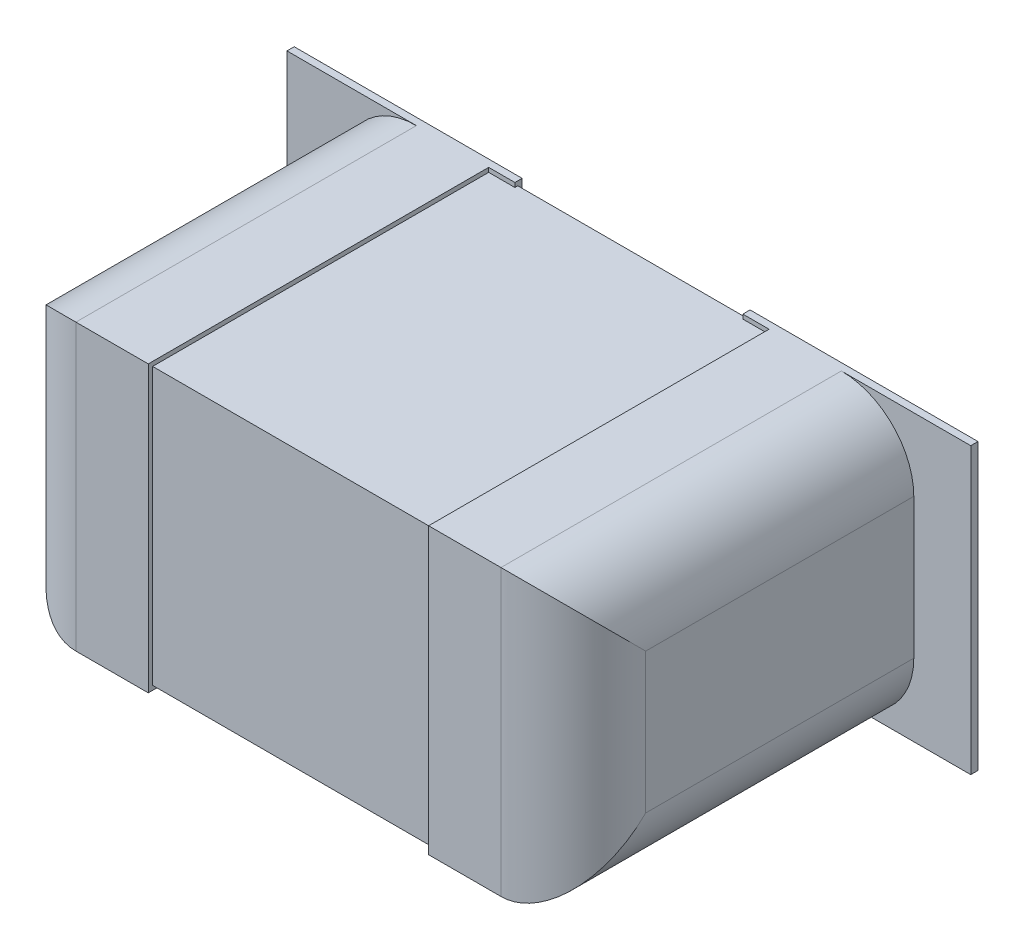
ISO-10303-21;
HEADER;
FILE_DESCRIPTION(('STEP AP214'),'2;1');
FILE_NAME('part.step','',(''),(''),'','','');
FILE_SCHEMA(('AUTOMOTIVE_DESIGN { 1 0 10303 214 1 1 1 1 }'));
ENDSEC;
DATA;
#1=APPLICATION_CONTEXT('core data for automotive mechanical design processes');
#2=APPLICATION_PROTOCOL_DEFINITION('international standard','automotive_design',2000,#1);
#3=PRODUCT_CONTEXT('',#1,'mechanical');
#4=PRODUCT('Part','Part','',(#3));
#5=PRODUCT_RELATED_PRODUCT_CATEGORY('part','',(#4));
#6=PRODUCT_DEFINITION_FORMATION('','',#4);
#7=PRODUCT_DEFINITION_CONTEXT('part definition',#1,'design');
#8=PRODUCT_DEFINITION('design','',#6,#7);
#9=PRODUCT_DEFINITION_SHAPE('','',#8);
#10=(LENGTH_UNIT() NAMED_UNIT(*) SI_UNIT(.MILLI.,.METRE.));
#11=(NAMED_UNIT(*) PLANE_ANGLE_UNIT() SI_UNIT($,.RADIAN.));
#12=(NAMED_UNIT(*) SI_UNIT($,.STERADIAN.) SOLID_ANGLE_UNIT());
#13=UNCERTAINTY_MEASURE_WITH_UNIT(LENGTH_MEASURE(1.E-05),#10,'distance_accuracy_value','');
#14=(GEOMETRIC_REPRESENTATION_CONTEXT(3) GLOBAL_UNCERTAINTY_ASSIGNED_CONTEXT((#13)) GLOBAL_UNIT_ASSIGNED_CONTEXT((#10,
#11,#12)) REPRESENTATION_CONTEXT('',''));
#15=CARTESIAN_POINT('',(0.,0.,0.));
#16=DIRECTION('',(0.,0.,1.));
#17=DIRECTION('',(1.,0.,0.));
#18=AXIS2_PLACEMENT_3D('',#15,#16,#17);
#19=CARTESIAN_POINT('',(0.500000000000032,-0.249999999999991,0.0762));
#20=DIRECTION('',(1.,0.,0.));
#21=DIRECTION('',(0.,0.,-1.));
#22=AXIS2_PLACEMENT_3D('',#19,#20,#21);
#23=PLANE('',#22);
#24=DIRECTION('',(0.,0.,-1.));
#25=VECTOR('',#24,1.);
#26=CARTESIAN_POINT('',(0.500000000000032,-0.122999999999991,0.68855504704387));
#27=LINE('',#26,#25);
#28=CARTESIAN_POINT('',(0.500000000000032,-0.122999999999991,0.0889));
#29=VERTEX_POINT('',#28);
#30=CARTESIAN_POINT('',(0.500000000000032,-0.122999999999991,0.559308));
#31=VERTEX_POINT('',#30);
#32=EDGE_CURVE('E324',#29,#31,#27,.F.);
#33=ORIENTED_EDGE('',*,*,#32,.F.);
#34=DIRECTION('',(0.,1.,0.));
#35=VECTOR('',#34,1.);
#36=CARTESIAN_POINT('',(0.500000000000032,0.,0.0889));
#37=LINE('',#36,#35);
#38=CARTESIAN_POINT('',(0.500000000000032,0.122999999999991,0.0889));
#39=VERTEX_POINT('',#38);
#40=EDGE_CURVE('E237',#39,#29,#37,.F.);
#41=ORIENTED_EDGE('',*,*,#40,.F.);
#42=DIRECTION('',(0.,0.,-1.));
#43=VECTOR('',#42,1.);
#44=CARTESIAN_POINT('',(0.500000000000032,0.122999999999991,0.68855504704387));
#45=LINE('',#44,#43);
#46=CARTESIAN_POINT('',(0.500000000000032,0.122999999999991,0.559308));
#47=VERTEX_POINT('',#46);
#48=EDGE_CURVE('E226',#47,#39,#45,.T.);
#49=ORIENTED_EDGE('',*,*,#48,.F.);
#50=DIRECTION('',(0.,1.,0.));
#51=VECTOR('',#50,1.);
#52=CARTESIAN_POINT('',(0.500000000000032,-0.252165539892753,0.559308));
#53=LINE('',#52,#51);
#54=EDGE_CURVE('E223',#31,#47,#53,.T.);
#55=ORIENTED_EDGE('',*,*,#54,.F.);
#56=EDGE_LOOP('',(#33,#41,#49,#55));
#57=FACE_BOUND('',#56,.T.);
#58=ADVANCED_FACE('F16',(#57),#23,.T.);
#59=CARTESIAN_POINT('',(-0.500000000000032,0.249999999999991,0.0762));
#60=DIRECTION('',(-1.,0.,0.));
#61=DIRECTION('',(0.,0.,1.));
#62=AXIS2_PLACEMENT_3D('',#59,#60,#61);
#63=PLANE('',#62);
#64=DIRECTION('',(0.,0.,-1.));
#65=VECTOR('',#64,1.);
#66=CARTESIAN_POINT('',(-0.500000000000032,0.122999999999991,0.68855504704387));
#67=LINE('',#66,#65);
#68=CARTESIAN_POINT('',(-0.500000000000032,0.122999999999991,0.0889));
#69=VERTEX_POINT('',#68);
#70=CARTESIAN_POINT('',(-0.500000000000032,0.122999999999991,0.559308));
#71=VERTEX_POINT('',#70);
#72=EDGE_CURVE('E308',#69,#71,#67,.F.);
#73=ORIENTED_EDGE('',*,*,#72,.F.);
#74=DIRECTION('',(0.,1.,0.));
#75=VECTOR('',#74,1.);
#76=CARTESIAN_POINT('',(-0.500000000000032,0.,0.0889));
#77=LINE('',#76,#75);
#78=CARTESIAN_POINT('',(-0.500000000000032,-0.122999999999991,0.0889));
#79=VERTEX_POINT('',#78);
#80=EDGE_CURVE('E312',#79,#69,#77,.T.);
#81=ORIENTED_EDGE('',*,*,#80,.F.);
#82=DIRECTION('',(0.,0.,-1.));
#83=VECTOR('',#82,1.);
#84=CARTESIAN_POINT('',(-0.500000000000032,-0.122999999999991,0.68855504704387));
#85=LINE('',#84,#83);
#86=CARTESIAN_POINT('',(-0.500000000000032,-0.122999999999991,0.559308));
#87=VERTEX_POINT('',#86);
#88=EDGE_CURVE('E315',#87,#79,#85,.T.);
#89=ORIENTED_EDGE('',*,*,#88,.F.);
#90=DIRECTION('',(0.,-1.,0.));
#91=VECTOR('',#90,1.);
#92=CARTESIAN_POINT('',(-0.500000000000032,0.25220810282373,0.559308));
#93=LINE('',#92,#91);
#94=EDGE_CURVE('E242',#71,#87,#93,.T.);
#95=ORIENTED_EDGE('',*,*,#94,.F.);
#96=EDGE_LOOP('',(#73,#81,#89,#95));
#97=FACE_BOUND('',#96,.T.);
#98=ADVANCED_FACE('F355',(#97),#63,.T.);
#99=CARTESIAN_POINT('',(-0.373000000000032,0.25220810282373,0.559308));
#100=DIRECTION('',(0.,-1.,0.));
#101=DIRECTION('',(0.,0.,-1.));
#102=AXIS2_PLACEMENT_3D('',#99,#100,#101);
#103=CYLINDRICAL_SURFACE('',#102,0.127);
#104=CARTESIAN_POINT('',(-0.373000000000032,-0.122999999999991,0.559308));
#105=DIRECTION('',(0.,-0.707106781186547,-0.707106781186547));
#106=DIRECTION('',(0.,0.707106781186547,-0.707106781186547));
#107=AXIS2_PLACEMENT_3D('',#104,#105,#106);
#108=ELLIPSE('',#107,0.179605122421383,0.127);
#109=CARTESIAN_POINT('',(-0.373000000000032,-0.249999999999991,0.686308));
#110=VERTEX_POINT('',#109);
#111=EDGE_CURVE('E316',#110,#87,#108,.T.);
#112=ORIENTED_EDGE('',*,*,#111,.F.);
#113=DIRECTION('',(0.,1.,0.));
#114=VECTOR('',#113,1.);
#115=CARTESIAN_POINT('',(-0.373000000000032,0.,0.686308));
#116=LINE('',#115,#114);
#117=CARTESIAN_POINT('',(-0.373000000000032,0.249999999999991,0.686308));
#118=VERTEX_POINT('',#117);
#119=EDGE_CURVE('E207',#118,#110,#116,.F.);
#120=ORIENTED_EDGE('',*,*,#119,.F.);
#121=CARTESIAN_POINT('',(-0.373000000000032,0.122999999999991,0.559308));
#122=DIRECTION('',(0.,0.707106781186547,-0.707106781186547));
#123=DIRECTION('',(0.,-0.707106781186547,-0.707106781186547));
#124=AXIS2_PLACEMENT_3D('',#121,#122,#123);
#125=ELLIPSE('',#124,0.179605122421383,0.127);
#126=EDGE_CURVE('E306',#71,#118,#125,.T.);
#127=ORIENTED_EDGE('',*,*,#126,.F.);
#128=ORIENTED_EDGE('',*,*,#94,.T.);
#129=EDGE_LOOP('',(#112,#120,#127,#128));
#130=FACE_BOUND('',#129,.T.);
#131=ADVANCED_FACE('F360',(#130),#103,.T.);
#132=CARTESIAN_POINT('',(0.373000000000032,-0.252165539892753,0.559308));
#133=DIRECTION('',(0.,1.,0.));
#134=DIRECTION('',(0.,0.,1.));
#135=AXIS2_PLACEMENT_3D('',#132,#133,#134);
#136=CYLINDRICAL_SURFACE('',#135,0.127);
#137=CARTESIAN_POINT('',(0.373000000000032,-0.122999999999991,0.559308));
#138=DIRECTION('',(0.,-0.707106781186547,-0.707106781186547));
#139=DIRECTION('',(0.,0.707106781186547,-0.707106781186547));
#140=AXIS2_PLACEMENT_3D('',#137,#138,#139);
#141=ELLIPSE('',#140,0.179605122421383,0.127);
#142=CARTESIAN_POINT('',(0.373000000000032,-0.249999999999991,0.686308));
#143=VERTEX_POINT('',#142);
#144=EDGE_CURVE('E322',#31,#143,#141,.T.);
#145=ORIENTED_EDGE('',*,*,#144,.F.);
#146=ORIENTED_EDGE('',*,*,#54,.T.);
#147=CARTESIAN_POINT('',(0.373000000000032,0.122999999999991,0.559308));
#148=DIRECTION('',(0.,0.707106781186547,-0.707106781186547));
#149=DIRECTION('',(0.,-0.707106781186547,-0.707106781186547));
#150=AXIS2_PLACEMENT_3D('',#147,#148,#149);
#151=ELLIPSE('',#150,0.179605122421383,0.127);
#152=CARTESIAN_POINT('',(0.373000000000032,0.249999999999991,0.686308));
#153=VERTEX_POINT('',#152);
#154=EDGE_CURVE('E19',#153,#47,#151,.T.);
#155=ORIENTED_EDGE('',*,*,#154,.F.);
#156=DIRECTION('',(0.,1.,0.));
#157=VECTOR('',#156,1.);
#158=CARTESIAN_POINT('',(0.373000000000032,0.,0.686308));
#159=LINE('',#158,#157);
#160=EDGE_CURVE('E197',#143,#153,#159,.T.);
#161=ORIENTED_EDGE('',*,*,#160,.F.);
#162=EDGE_LOOP('',(#145,#146,#155,#161));
#163=FACE_BOUND('',#162,.T.);
#164=ADVANCED_FACE('F221',(#163),#136,.T.);
#165=CARTESIAN_POINT('',(0.373000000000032,0.122999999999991,0.68855504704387));
#166=DIRECTION('',(0.,0.,-1.));
#167=DIRECTION('',(-1.,0.,0.));
#168=AXIS2_PLACEMENT_3D('',#165,#166,#167);
#169=CYLINDRICAL_SURFACE('',#168,0.127);
#170=ORIENTED_EDGE('',*,*,#48,.T.);
#171=CARTESIAN_POINT('',(0.373000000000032,0.122999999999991,0.0888999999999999));
#172=DIRECTION('',(0.,0.,-1.));
#173=DIRECTION('',(-1.,0.,0.));
#174=AXIS2_PLACEMENT_3D('',#171,#172,#173);
#175=CIRCLE('',#174,0.127);
#176=CARTESIAN_POINT('',(0.372860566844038,0.249999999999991,0.0889000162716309));
#177=VERTEX_POINT('',#176);
#178=EDGE_CURVE('E229',#177,#39,#175,.T.);
#179=ORIENTED_EDGE('',*,*,#178,.F.);
#180=DIRECTION('',(-0.000233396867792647,0.,-0.999999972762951));
#181=VECTOR('',#180,1.);
#182=CARTESIAN_POINT('',(0.373000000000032,0.249999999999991,0.686308));
#183=LINE('',#182,#181);
#184=EDGE_CURVE('E214',#153,#177,#183,.T.);
#185=ORIENTED_EDGE('',*,*,#184,.F.);
#186=ORIENTED_EDGE('',*,*,#154,.T.);
#187=EDGE_LOOP('',(#170,#179,#185,#186));
#188=FACE_BOUND('',#187,.T.);
#189=ADVANCED_FACE('F227',(#188),#169,.T.);
#190=CARTESIAN_POINT('',(0.5999988,-0.2500122,0.0762));
#191=DIRECTION('',(1.,0.,0.));
#192=DIRECTION('',(0.,0.,-1.));
#193=AXIS2_PLACEMENT_3D('',#190,#191,#192);
#194=PLANE('',#193);
#195=DIRECTION('',(0.,0.,-1.));
#196=VECTOR('',#195,1.);
#197=CARTESIAN_POINT('',(0.5999988,-0.249999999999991,0.0762));
#198=LINE('',#197,#196);
#199=CARTESIAN_POINT('',(0.5999988,-0.249999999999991,0.0762));
#200=VERTEX_POINT('',#199);
#201=CARTESIAN_POINT('',(0.5999988,-0.249999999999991,0.0889));
#202=VERTEX_POINT('',#201);
#203=EDGE_CURVE('E294',#200,#202,#198,.F.);
#204=ORIENTED_EDGE('',*,*,#203,.F.);
#205=DIRECTION('',(0.,1.,0.));
#206=VECTOR('',#205,1.);
#207=CARTESIAN_POINT('',(0.5999988,0.,0.0762));
#208=LINE('',#207,#206);
#209=CARTESIAN_POINT('',(0.5999988,0.249999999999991,0.0762));
#210=VERTEX_POINT('',#209);
#211=EDGE_CURVE('E297',#200,#210,#208,.T.);
#212=ORIENTED_EDGE('',*,*,#211,.T.);
#213=DIRECTION('',(0.,0.,1.));
#214=VECTOR('',#213,1.);
#215=CARTESIAN_POINT('',(0.5999988,0.249999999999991,0.0762));
#216=LINE('',#215,#214);
#217=CARTESIAN_POINT('',(0.5999988,0.249999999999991,0.0889));
#218=VERTEX_POINT('',#217);
#219=EDGE_CURVE('E233',#218,#210,#216,.F.);
#220=ORIENTED_EDGE('',*,*,#219,.F.);
#221=DIRECTION('',(0.,1.,0.));
#222=VECTOR('',#221,1.);
#223=CARTESIAN_POINT('',(0.5999988,0.,0.0889));
#224=LINE('',#223,#222);
#225=EDGE_CURVE('E240',#202,#218,#224,.T.);
#226=ORIENTED_EDGE('',*,*,#225,.F.);
#227=EDGE_LOOP('',(#204,#212,#220,#226));
#228=FACE_BOUND('',#227,.T.);
#229=ADVANCED_FACE('F335',(#228),#194,.T.);
#230=CARTESIAN_POINT('',(0.,0.,0.0889));
#231=DIRECTION('',(0.,0.,1.));
#232=DIRECTION('',(1.,0.,0.));
#233=AXIS2_PLACEMENT_3D('',#230,#231,#232);
#234=PLANE('',#233);
#235=ORIENTED_EDGE('',*,*,#178,.T.);
#236=ORIENTED_EDGE('',*,*,#40,.T.);
#237=CARTESIAN_POINT('',(0.373000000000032,-0.122999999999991,0.0888999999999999));
#238=DIRECTION('',(0.,0.,-1.));
#239=DIRECTION('',(-1.,0.,0.));
#240=AXIS2_PLACEMENT_3D('',#237,#238,#239);
#241=CIRCLE('',#240,0.127);
#242=CARTESIAN_POINT('',(0.372860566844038,-0.249999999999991,0.0889000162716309));
#243=VERTEX_POINT('',#242);
#244=EDGE_CURVE('E319',#243,#29,#241,.F.);
#245=ORIENTED_EDGE('',*,*,#244,.F.);
#246=DIRECTION('',(1.,0.,0.));
#247=VECTOR('',#246,1.);
#248=CARTESIAN_POINT('',(-0.500000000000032,-0.249999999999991,0.0889));
#249=LINE('',#248,#247);
#250=EDGE_CURVE('E296',#202,#243,#249,.F.);
#251=ORIENTED_EDGE('',*,*,#250,.F.);
#252=ORIENTED_EDGE('',*,*,#225,.T.);
#253=DIRECTION('',(1.,0.,0.));
#254=VECTOR('',#253,1.);
#255=CARTESIAN_POINT('',(0.500000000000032,0.249999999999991,0.0889));
#256=LINE('',#255,#254);
#257=EDGE_CURVE('E231',#177,#218,#256,.T.);
#258=ORIENTED_EDGE('',*,*,#257,.F.);
#259=EDGE_LOOP('',(#235,#236,#245,#251,#252,#258));
#260=FACE_BOUND('',#259,.T.);
#261=ADVANCED_FACE('F328',(#260),#234,.T.);
#262=CARTESIAN_POINT('',(0.373000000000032,-0.122999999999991,0.68855504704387));
#263=DIRECTION('',(0.,0.,-1.));
#264=DIRECTION('',(-1.,0.,0.));
#265=AXIS2_PLACEMENT_3D('',#262,#263,#264);
#266=CYLINDRICAL_SURFACE('',#265,0.127);
#267=DIRECTION('',(0.000233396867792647,0.,0.999999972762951));
#268=VECTOR('',#267,1.);
#269=CARTESIAN_POINT('',(0.37286056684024,-0.249999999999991,0.0889));
#270=LINE('',#269,#268);
#271=EDGE_CURVE('E342',#243,#143,#270,.T.);
#272=ORIENTED_EDGE('',*,*,#271,.F.);
#273=ORIENTED_EDGE('',*,*,#244,.T.);
#274=ORIENTED_EDGE('',*,*,#32,.T.);
#275=ORIENTED_EDGE('',*,*,#144,.T.);
#276=EDGE_LOOP('',(#272,#273,#274,#275));
#277=FACE_BOUND('',#276,.T.);
#278=ADVANCED_FACE('F352',(#277),#266,.T.);
#279=CARTESIAN_POINT('',(-0.373000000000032,-0.122999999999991,0.68855504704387));
#280=DIRECTION('',(0.,0.,-1.));
#281=DIRECTION('',(-1.,0.,0.));
#282=AXIS2_PLACEMENT_3D('',#279,#280,#281);
#283=CYLINDRICAL_SURFACE('',#282,0.127);
#284=ORIENTED_EDGE('',*,*,#88,.T.);
#285=CARTESIAN_POINT('',(-0.373000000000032,-0.122999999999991,0.0888999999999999));
#286=DIRECTION('',(0.,0.,-1.));
#287=DIRECTION('',(-1.,0.,0.));
#288=AXIS2_PLACEMENT_3D('',#285,#286,#287);
#289=CIRCLE('',#288,0.127);
#290=CARTESIAN_POINT('',(-0.372860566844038,-0.249999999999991,0.0889000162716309));
#291=VERTEX_POINT('',#290);
#292=EDGE_CURVE('E309',#291,#79,#289,.T.);
#293=ORIENTED_EDGE('',*,*,#292,.F.);
#294=DIRECTION('',(0.000233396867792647,0.,-0.999999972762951));
#295=VECTOR('',#294,1.);
#296=CARTESIAN_POINT('',(-0.373000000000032,-0.249999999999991,0.686308));
#297=LINE('',#296,#295);
#298=EDGE_CURVE('E289',#110,#291,#297,.T.);
#299=ORIENTED_EDGE('',*,*,#298,.F.);
#300=ORIENTED_EDGE('',*,*,#111,.T.);
#301=EDGE_LOOP('',(#284,#293,#299,#300));
#302=FACE_BOUND('',#301,.T.);
#303=ADVANCED_FACE('F449',(#302),#283,.T.);
#304=CARTESIAN_POINT('',(-0.5999988,0.2500122,0.0762));
#305=DIRECTION('',(-1.,0.,0.));
#306=DIRECTION('',(0.,0.,1.));
#307=AXIS2_PLACEMENT_3D('',#304,#305,#306);
#308=PLANE('',#307);
#309=DIRECTION('',(0.,0.,1.));
#310=VECTOR('',#309,1.);
#311=CARTESIAN_POINT('',(-0.5999988,0.249999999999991,0.0762));
#312=LINE('',#311,#310);
#313=CARTESIAN_POINT('',(-0.5999988,0.249999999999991,0.0762));
#314=VERTEX_POINT('',#313);
#315=CARTESIAN_POINT('',(-0.5999988,0.249999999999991,0.0889));
#316=VERTEX_POINT('',#315);
#317=EDGE_CURVE('E277',#314,#316,#312,.T.);
#318=ORIENTED_EDGE('',*,*,#317,.F.);
#319=DIRECTION('',(0.,1.,0.));
#320=VECTOR('',#319,1.);
#321=CARTESIAN_POINT('',(-0.5999988,0.,0.0762));
#322=LINE('',#321,#320);
#323=CARTESIAN_POINT('',(-0.5999988,-0.249999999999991,0.0762));
#324=VERTEX_POINT('',#323);
#325=EDGE_CURVE('E280',#314,#324,#322,.F.);
#326=ORIENTED_EDGE('',*,*,#325,.T.);
#327=DIRECTION('',(0.,0.,-1.));
#328=VECTOR('',#327,1.);
#329=CARTESIAN_POINT('',(-0.5999988,-0.249999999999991,0.0762));
#330=LINE('',#329,#328);
#331=CARTESIAN_POINT('',(-0.5999988,-0.249999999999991,0.0889));
#332=VERTEX_POINT('',#331);
#333=EDGE_CURVE('E284',#332,#324,#330,.T.);
#334=ORIENTED_EDGE('',*,*,#333,.F.);
#335=DIRECTION('',(0.,1.,0.));
#336=VECTOR('',#335,1.);
#337=CARTESIAN_POINT('',(-0.5999988,0.,0.0889));
#338=LINE('',#337,#336);
#339=EDGE_CURVE('E313',#316,#332,#338,.F.);
#340=ORIENTED_EDGE('',*,*,#339,.F.);
#341=EDGE_LOOP('',(#318,#326,#334,#340));
#342=FACE_BOUND('',#341,.T.);
#343=ADVANCED_FACE('F445',(#342),#308,.T.);
#344=CARTESIAN_POINT('',(0.,0.,0.0889));
#345=DIRECTION('',(0.,0.,1.));
#346=DIRECTION('',(1.,0.,0.));
#347=AXIS2_PLACEMENT_3D('',#344,#345,#346);
#348=PLANE('',#347);
#349=ORIENTED_EDGE('',*,*,#292,.T.);
#350=ORIENTED_EDGE('',*,*,#80,.T.);
#351=CARTESIAN_POINT('',(-0.373000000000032,0.122999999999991,0.0888999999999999));
#352=DIRECTION('',(0.,0.,-1.));
#353=DIRECTION('',(-1.,0.,0.));
#354=AXIS2_PLACEMENT_3D('',#351,#352,#353);
#355=CIRCLE('',#354,0.127);
#356=CARTESIAN_POINT('',(-0.372860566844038,0.249999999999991,0.0889000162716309));
#357=VERTEX_POINT('',#356);
#358=EDGE_CURVE('E303',#357,#69,#355,.F.);
#359=ORIENTED_EDGE('',*,*,#358,.F.);
#360=DIRECTION('',(1.,0.,0.));
#361=VECTOR('',#360,1.);
#362=CARTESIAN_POINT('',(0.500000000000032,0.249999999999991,0.0889));
#363=LINE('',#362,#361);
#364=EDGE_CURVE('E279',#316,#357,#363,.T.);
#365=ORIENTED_EDGE('',*,*,#364,.F.);
#366=ORIENTED_EDGE('',*,*,#339,.T.);
#367=DIRECTION('',(1.,0.,0.));
#368=VECTOR('',#367,1.);
#369=CARTESIAN_POINT('',(-0.500000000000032,-0.249999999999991,0.0889));
#370=LINE('',#369,#368);
#371=EDGE_CURVE('E286',#291,#332,#370,.F.);
#372=ORIENTED_EDGE('',*,*,#371,.F.);
#373=EDGE_LOOP('',(#349,#350,#359,#365,#366,#372));
#374=FACE_BOUND('',#373,.T.);
#375=ADVANCED_FACE('F441',(#374),#348,.T.);
#376=CARTESIAN_POINT('',(-0.373000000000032,0.122999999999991,0.68855504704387));
#377=DIRECTION('',(0.,0.,-1.));
#378=DIRECTION('',(-1.,0.,0.));
#379=AXIS2_PLACEMENT_3D('',#376,#377,#378);
#380=CYLINDRICAL_SURFACE('',#379,0.127);
#381=DIRECTION('',(-0.000233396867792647,0.,0.999999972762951));
#382=VECTOR('',#381,1.);
#383=CARTESIAN_POINT('',(-0.37286056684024,0.249999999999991,0.0889));
#384=LINE('',#383,#382);
#385=EDGE_CURVE('E482',#357,#118,#384,.T.);
#386=ORIENTED_EDGE('',*,*,#385,.F.);
#387=ORIENTED_EDGE('',*,*,#358,.T.);
#388=ORIENTED_EDGE('',*,*,#72,.T.);
#389=ORIENTED_EDGE('',*,*,#126,.T.);
#390=EDGE_LOOP('',(#386,#387,#388,#389));
#391=FACE_BOUND('',#390,.T.);
#392=ADVANCED_FACE('F437',(#391),#380,.T.);
#393=CARTESIAN_POINT('',(0.,0.,0.686308));
#394=DIRECTION('',(0.,0.,1.));
#395=DIRECTION('',(1.,0.,0.));
#396=AXIS2_PLACEMENT_3D('',#393,#394,#395);
#397=PLANE('',#396);
#398=DIRECTION('',(1.,0.,0.));
#399=VECTOR('',#398,1.);
#400=CARTESIAN_POINT('',(0.500000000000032,0.249999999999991,0.686308));
#401=LINE('',#400,#399);
#402=CARTESIAN_POINT('',(-0.246000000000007,0.249999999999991,0.686308));
#403=VERTEX_POINT('',#402);
#404=EDGE_CURVE('E276',#118,#403,#401,.T.);
#405=ORIENTED_EDGE('',*,*,#404,.F.);
#406=ORIENTED_EDGE('',*,*,#119,.T.);
#407=DIRECTION('',(1.,0.,0.));
#408=VECTOR('',#407,1.);
#409=CARTESIAN_POINT('',(-0.500000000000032,-0.249999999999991,0.686308));
#410=LINE('',#409,#408);
#411=CARTESIAN_POINT('',(-0.246000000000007,-0.250002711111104,0.686308));
#412=VERTEX_POINT('',#411);
#413=EDGE_CURVE('E293',#412,#110,#410,.F.);
#414=ORIENTED_EDGE('',*,*,#413,.F.);
#415=DIRECTION('',(0.,1.,0.));
#416=VECTOR('',#415,1.);
#417=CARTESIAN_POINT('',(-0.246000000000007,-0.249999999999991,0.686308));
#418=LINE('',#417,#416);
#419=EDGE_CURVE('E513',#412,#403,#418,.T.);
#420=ORIENTED_EDGE('',*,*,#419,.T.);
#421=EDGE_LOOP('',(#405,#406,#414,#420));
#422=FACE_BOUND('',#421,.T.);
#423=ADVANCED_FACE('F434',(#422),#397,.T.);
#424=CARTESIAN_POINT('',(0.,0.,0.686308));
#425=DIRECTION('',(0.,0.,1.));
#426=DIRECTION('',(1.,0.,0.));
#427=AXIS2_PLACEMENT_3D('',#424,#425,#426);
#428=PLANE('',#427);
#429=DIRECTION('',(1.,0.,0.));
#430=VECTOR('',#429,1.);
#431=CARTESIAN_POINT('',(-0.500000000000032,-0.249999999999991,0.686308));
#432=LINE('',#431,#430);
#433=CARTESIAN_POINT('',(0.246000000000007,-0.249999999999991,0.686308));
#434=VERTEX_POINT('',#433);
#435=EDGE_CURVE('E203',#143,#434,#432,.F.);
#436=ORIENTED_EDGE('',*,*,#435,.F.);
#437=ORIENTED_EDGE('',*,*,#160,.T.);
#438=DIRECTION('',(1.,0.,0.));
#439=VECTOR('',#438,1.);
#440=CARTESIAN_POINT('',(0.500000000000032,0.249999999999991,0.686308));
#441=LINE('',#440,#439);
#442=CARTESIAN_POINT('',(0.246000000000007,0.250002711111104,0.686308));
#443=VERTEX_POINT('',#442);
#444=EDGE_CURVE('E201',#443,#153,#441,.T.);
#445=ORIENTED_EDGE('',*,*,#444,.F.);
#446=DIRECTION('',(0.,1.,0.));
#447=VECTOR('',#446,1.);
#448=CARTESIAN_POINT('',(0.246000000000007,-0.249999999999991,0.686308));
#449=LINE('',#448,#447);
#450=EDGE_CURVE('E568',#443,#434,#449,.F.);
#451=ORIENTED_EDGE('',*,*,#450,.T.);
#452=EDGE_LOOP('',(#436,#437,#445,#451));
#453=FACE_BOUND('',#452,.T.);
#454=ADVANCED_FACE('F199',(#453),#428,.T.);
#455=CARTESIAN_POINT('',(0.,0.,0.0889));
#456=DIRECTION('',(0.,0.,1.));
#457=DIRECTION('',(1.,0.,0.));
#458=AXIS2_PLACEMENT_3D('',#455,#456,#457);
#459=PLANE('',#458);
#460=DIRECTION('',(1.,0.,0.));
#461=VECTOR('',#460,1.);
#462=CARTESIAN_POINT('',(-0.246000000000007,0.242379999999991,0.0889));
#463=LINE('',#462,#461);
#464=CARTESIAN_POINT('',(0.1999996,0.242379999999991,0.0889));
#465=VERTEX_POINT('',#464);
#466=CARTESIAN_POINT('',(0.246000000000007,0.242379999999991,0.0889));
#467=VERTEX_POINT('',#466);
#468=EDGE_CURVE('E529',#465,#467,#463,.T.);
#469=ORIENTED_EDGE('',*,*,#468,.T.);
#470=DIRECTION('',(0.,1.,0.));
#471=VECTOR('',#470,1.);
#472=CARTESIAN_POINT('',(0.246000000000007,-0.249999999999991,0.0889));
#473=LINE('',#472,#471);
#474=CARTESIAN_POINT('',(0.246000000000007,0.250002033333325,0.0889));
#475=VERTEX_POINT('',#474);
#476=EDGE_CURVE('E558',#467,#475,#473,.T.);
#477=ORIENTED_EDGE('',*,*,#476,.T.);
#478=DIRECTION('',(1.,0.,0.));
#479=VECTOR('',#478,1.);
#480=CARTESIAN_POINT('',(0.500000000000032,0.249999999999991,0.0889));
#481=LINE('',#480,#479);
#482=CARTESIAN_POINT('',(0.1999996,0.249999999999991,0.0889));
#483=VERTEX_POINT('',#482);
#484=EDGE_CURVE('E301',#483,#475,#481,.T.);
#485=ORIENTED_EDGE('',*,*,#484,.F.);
#486=DIRECTION('',(0.,1.,0.));
#487=VECTOR('',#486,1.);
#488=CARTESIAN_POINT('',(0.1999996,0.2500122,0.0889));
#489=LINE('',#488,#487);
#490=EDGE_CURVE('E257',#465,#483,#489,.T.);
#491=ORIENTED_EDGE('',*,*,#490,.F.);
#492=EDGE_LOOP('',(#469,#477,#485,#491));
#493=FACE_BOUND('',#492,.T.);
#494=ADVANCED_FACE('F428',(#493),#459,.T.);
#495=CARTESIAN_POINT('',(0.500000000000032,0.249999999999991,0.0762));
#496=DIRECTION('',(0.,1.,0.));
#497=DIRECTION('',(0.,0.,1.));
#498=AXIS2_PLACEMENT_3D('',#495,#496,#497);
#499=PLANE('',#498);
#500=ORIENTED_EDGE('',*,*,#484,.T.);
#501=DIRECTION('',(0.,0.,-1.));
#502=VECTOR('',#501,1.);
#503=CARTESIAN_POINT('',(0.246000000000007,0.25000406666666,0.08382));
#504=LINE('',#503,#502);
#505=EDGE_CURVE('E217',#475,#443,#504,.F.);
#506=ORIENTED_EDGE('',*,*,#505,.T.);
#507=ORIENTED_EDGE('',*,*,#444,.T.);
#508=ORIENTED_EDGE('',*,*,#184,.T.);
#509=ORIENTED_EDGE('',*,*,#257,.T.);
#510=ORIENTED_EDGE('',*,*,#219,.T.);
#511=DIRECTION('',(1.,0.,0.));
#512=VECTOR('',#511,1.);
#513=CARTESIAN_POINT('',(0.500000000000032,0.249999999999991,0.0762));
#514=LINE('',#513,#512);
#515=CARTESIAN_POINT('',(0.1999996,0.249999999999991,0.0762));
#516=VERTEX_POINT('',#515);
#517=EDGE_CURVE('E298',#210,#516,#514,.F.);
#518=ORIENTED_EDGE('',*,*,#517,.T.);
#519=DIRECTION('',(0.,0.,-1.));
#520=VECTOR('',#519,1.);
#521=CARTESIAN_POINT('',(0.1999996,0.249999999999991,0.0762));
#522=LINE('',#521,#520);
#523=EDGE_CURVE('E255',#483,#516,#522,.T.);
#524=ORIENTED_EDGE('',*,*,#523,.F.);
#525=EDGE_LOOP('',(#500,#506,#507,#508,#509,#510,#518,#524));
#526=FACE_BOUND('',#525,.T.);
#527=ADVANCED_FACE('F211',(#526),#499,.T.);
#528=CARTESIAN_POINT('',(0.,0.,0.0762));
#529=DIRECTION('',(0.,0.,1.));
#530=DIRECTION('',(1.,0.,0.));
#531=AXIS2_PLACEMENT_3D('',#528,#529,#530);
#532=PLANE('',#531);
#533=DIRECTION('',(1.,0.,0.));
#534=VECTOR('',#533,1.);
#535=CARTESIAN_POINT('',(-0.500000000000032,-0.249999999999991,0.0762));
#536=LINE('',#535,#534);
#537=CARTESIAN_POINT('',(0.1999996,-0.249999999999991,0.0762));
#538=VERTEX_POINT('',#537);
#539=EDGE_CURVE('E290',#538,#200,#536,.T.);
#540=ORIENTED_EDGE('',*,*,#539,.F.);
#541=DIRECTION('',(0.,1.,0.));
#542=VECTOR('',#541,1.);
#543=CARTESIAN_POINT('',(0.1999996,0.2500122,0.0762));
#544=LINE('',#543,#542);
#545=EDGE_CURVE('E254',#516,#538,#544,.F.);
#546=ORIENTED_EDGE('',*,*,#545,.F.);
#547=ORIENTED_EDGE('',*,*,#517,.F.);
#548=ORIENTED_EDGE('',*,*,#211,.F.);
#549=EDGE_LOOP('',(#540,#546,#547,#548));
#550=FACE_BOUND('',#549,.T.);
#551=ADVANCED_FACE('F423',(#550),#532,.F.);
#552=CARTESIAN_POINT('',(-0.500000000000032,-0.249999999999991,0.0762));
#553=DIRECTION('',(0.,-1.,0.));
#554=DIRECTION('',(0.,0.,-1.));
#555=AXIS2_PLACEMENT_3D('',#552,#553,#554);
#556=PLANE('',#555);
#557=DIRECTION('',(0.,0.,1.));
#558=VECTOR('',#557,1.);
#559=CARTESIAN_POINT('',(0.1999996,-0.249999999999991,0.0762));
#560=LINE('',#559,#558);
#561=CARTESIAN_POINT('',(0.1999996,-0.249999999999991,0.0889));
#562=VERTEX_POINT('',#561);
#563=EDGE_CURVE('E251',#538,#562,#560,.T.);
#564=ORIENTED_EDGE('',*,*,#563,.F.);
#565=ORIENTED_EDGE('',*,*,#539,.T.);
#566=ORIENTED_EDGE('',*,*,#203,.T.);
#567=ORIENTED_EDGE('',*,*,#250,.T.);
#568=ORIENTED_EDGE('',*,*,#271,.T.);
#569=ORIENTED_EDGE('',*,*,#435,.T.);
#570=DIRECTION('',(0.,0.,-1.));
#571=VECTOR('',#570,1.);
#572=CARTESIAN_POINT('',(0.246000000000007,-0.249999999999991,0.08382));
#573=LINE('',#572,#571);
#574=CARTESIAN_POINT('',(0.246000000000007,-0.249999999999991,0.0889));
#575=VERTEX_POINT('',#574);
#576=EDGE_CURVE('E264',#434,#575,#573,.T.);
#577=ORIENTED_EDGE('',*,*,#576,.T.);
#578=DIRECTION('',(1.,0.,0.));
#579=VECTOR('',#578,1.);
#580=CARTESIAN_POINT('',(0.,-0.249999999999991,0.0889));
#581=LINE('',#580,#579);
#582=EDGE_CURVE('E258',#562,#575,#581,.T.);
#583=ORIENTED_EDGE('',*,*,#582,.F.);
#584=EDGE_LOOP('',(#564,#565,#566,#567,#568,#569,#577,#583));
#585=FACE_BOUND('',#584,.T.);
#586=ADVANCED_FACE('F347',(#585),#556,.T.);
#587=CARTESIAN_POINT('',(-0.500000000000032,-0.249999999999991,0.0762));
#588=DIRECTION('',(0.,-1.,0.));
#589=DIRECTION('',(0.,0.,-1.));
#590=AXIS2_PLACEMENT_3D('',#587,#588,#589);
#591=PLANE('',#590);
#592=DIRECTION('',(1.,0.,0.));
#593=VECTOR('',#592,1.);
#594=CARTESIAN_POINT('',(0.,-0.25000406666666,0.0889));
#595=LINE('',#594,#593);
#596=CARTESIAN_POINT('',(-0.246000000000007,-0.250003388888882,0.0889));
#597=VERTEX_POINT('',#596);
#598=CARTESIAN_POINT('',(-0.1999996,-0.250002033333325,0.0889));
#599=VERTEX_POINT('',#598);
#600=EDGE_CURVE('E506',#597,#599,#595,.T.);
#601=ORIENTED_EDGE('',*,*,#600,.F.);
#602=DIRECTION('',(0.,0.,1.));
#603=VECTOR('',#602,1.);
#604=CARTESIAN_POINT('',(-0.246000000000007,-0.25000406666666,0.0762));
#605=LINE('',#604,#603);
#606=EDGE_CURVE('E505',#597,#412,#605,.T.);
#607=ORIENTED_EDGE('',*,*,#606,.T.);
#608=ORIENTED_EDGE('',*,*,#413,.T.);
#609=ORIENTED_EDGE('',*,*,#298,.T.);
#610=ORIENTED_EDGE('',*,*,#371,.T.);
#611=ORIENTED_EDGE('',*,*,#333,.T.);
#612=DIRECTION('',(1.,0.,0.));
#613=VECTOR('',#612,1.);
#614=CARTESIAN_POINT('',(-0.500000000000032,-0.249999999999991,0.0762));
#615=LINE('',#614,#613);
#616=CARTESIAN_POINT('',(-0.1999996,-0.249999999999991,0.0762));
#617=VERTEX_POINT('',#616);
#618=EDGE_CURVE('E281',#324,#617,#615,.T.);
#619=ORIENTED_EDGE('',*,*,#618,.T.);
#620=DIRECTION('',(0.,0.,-1.));
#621=VECTOR('',#620,1.);
#622=CARTESIAN_POINT('',(-0.1999996,-0.249999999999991,0.0762));
#623=LINE('',#622,#621);
#624=EDGE_CURVE('E248',#599,#617,#623,.T.);
#625=ORIENTED_EDGE('',*,*,#624,.F.);
#626=EDGE_LOOP('',(#601,#607,#608,#609,#610,#611,#619,#625));
#627=FACE_BOUND('',#626,.T.);
#628=ADVANCED_FACE('F416',(#627),#591,.T.);
#629=CARTESIAN_POINT('',(0.,0.,0.0762));
#630=DIRECTION('',(0.,0.,1.));
#631=DIRECTION('',(1.,0.,0.));
#632=AXIS2_PLACEMENT_3D('',#629,#630,#631);
#633=PLANE('',#632);
#634=DIRECTION('',(1.,0.,0.));
#635=VECTOR('',#634,1.);
#636=CARTESIAN_POINT('',(0.500000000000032,0.249999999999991,0.0762));
#637=LINE('',#636,#635);
#638=CARTESIAN_POINT('',(-0.1999996,0.249999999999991,0.0762));
#639=VERTEX_POINT('',#638);
#640=EDGE_CURVE('E273',#639,#314,#637,.F.);
#641=ORIENTED_EDGE('',*,*,#640,.F.);
#642=DIRECTION('',(0.,1.,0.));
#643=VECTOR('',#642,1.);
#644=CARTESIAN_POINT('',(-0.1999996,-0.2500122,0.0762));
#645=LINE('',#644,#643);
#646=EDGE_CURVE('E247',#617,#639,#645,.T.);
#647=ORIENTED_EDGE('',*,*,#646,.F.);
#648=ORIENTED_EDGE('',*,*,#618,.F.);
#649=ORIENTED_EDGE('',*,*,#325,.F.);
#650=EDGE_LOOP('',(#641,#647,#648,#649));
#651=FACE_BOUND('',#650,.T.);
#652=ADVANCED_FACE('F412',(#651),#633,.F.);
#653=CARTESIAN_POINT('',(0.500000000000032,0.249999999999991,0.0762));
#654=DIRECTION('',(0.,1.,0.));
#655=DIRECTION('',(0.,0.,1.));
#656=AXIS2_PLACEMENT_3D('',#653,#654,#655);
#657=PLANE('',#656);
#658=DIRECTION('',(0.,0.,1.));
#659=VECTOR('',#658,1.);
#660=CARTESIAN_POINT('',(-0.1999996,0.249999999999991,0.0762));
#661=LINE('',#660,#659);
#662=CARTESIAN_POINT('',(-0.1999996,0.249999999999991,0.0889));
#663=VERTEX_POINT('',#662);
#664=EDGE_CURVE('E244',#639,#663,#661,.T.);
#665=ORIENTED_EDGE('',*,*,#664,.F.);
#666=ORIENTED_EDGE('',*,*,#640,.T.);
#667=ORIENTED_EDGE('',*,*,#317,.T.);
#668=ORIENTED_EDGE('',*,*,#364,.T.);
#669=ORIENTED_EDGE('',*,*,#385,.T.);
#670=ORIENTED_EDGE('',*,*,#404,.T.);
#671=DIRECTION('',(0.,0.,1.));
#672=VECTOR('',#671,1.);
#673=CARTESIAN_POINT('',(-0.246000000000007,0.249999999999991,0.0762));
#674=LINE('',#673,#672);
#675=CARTESIAN_POINT('',(-0.246000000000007,0.249999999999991,0.0889));
#676=VERTEX_POINT('',#675);
#677=EDGE_CURVE('E269',#403,#676,#674,.F.);
#678=ORIENTED_EDGE('',*,*,#677,.T.);
#679=DIRECTION('',(-1.,0.,0.));
#680=VECTOR('',#679,1.);
#681=CARTESIAN_POINT('',(0.,0.249999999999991,0.0889));
#682=LINE('',#681,#680);
#683=EDGE_CURVE('E270',#663,#676,#682,.T.);
#684=ORIENTED_EDGE('',*,*,#683,.F.);
#685=EDGE_LOOP('',(#665,#666,#667,#668,#669,#670,#678,#684));
#686=FACE_BOUND('',#685,.T.);
#687=ADVANCED_FACE('F408',(#686),#657,.T.);
#688=CARTESIAN_POINT('',(0.,0.,0.0889));
#689=DIRECTION('',(0.,0.,1.));
#690=DIRECTION('',(1.,0.,0.));
#691=AXIS2_PLACEMENT_3D('',#688,#689,#690);
#692=PLANE('',#691);
#693=DIRECTION('',(0.,1.,0.));
#694=VECTOR('',#693,1.);
#695=CARTESIAN_POINT('',(-0.1999996,-0.2500122,0.0889));
#696=LINE('',#695,#694);
#697=CARTESIAN_POINT('',(-0.1999996,0.242379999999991,0.0889));
#698=VERTEX_POINT('',#697);
#699=EDGE_CURVE('E246',#663,#698,#696,.F.);
#700=ORIENTED_EDGE('',*,*,#699,.F.);
#701=ORIENTED_EDGE('',*,*,#683,.T.);
#702=DIRECTION('',(0.,1.,0.));
#703=VECTOR('',#702,1.);
#704=CARTESIAN_POINT('',(-0.246000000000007,0.,0.0889));
#705=LINE('',#704,#703);
#706=CARTESIAN_POINT('',(-0.246000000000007,0.242379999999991,0.0889));
#707=VERTEX_POINT('',#706);
#708=EDGE_CURVE('E265',#676,#707,#705,.F.);
#709=ORIENTED_EDGE('',*,*,#708,.T.);
#710=DIRECTION('',(1.,0.,0.));
#711=VECTOR('',#710,1.);
#712=CARTESIAN_POINT('',(-0.246000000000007,0.242379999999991,0.0889));
#713=LINE('',#712,#711);
#714=EDGE_CURVE('E272',#707,#698,#713,.T.);
#715=ORIENTED_EDGE('',*,*,#714,.T.);
#716=EDGE_LOOP('',(#700,#701,#709,#715));
#717=FACE_BOUND('',#716,.T.);
#718=ADVANCED_FACE('F404',(#717),#692,.T.);
#719=CARTESIAN_POINT('',(-0.246000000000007,0.242379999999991,0.0762));
#720=DIRECTION('',(0.,-1.,0.));
#721=DIRECTION('',(0.,0.,-1.));
#722=AXIS2_PLACEMENT_3D('',#719,#720,#721);
#723=PLANE('',#722);
#724=DIRECTION('',(-1.,0.,0.));
#725=VECTOR('',#724,1.);
#726=CARTESIAN_POINT('',(-0.246000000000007,0.242379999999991,0.678688));
#727=LINE('',#726,#725);
#728=CARTESIAN_POINT('',(-0.246000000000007,0.242379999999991,0.678688));
#729=VERTEX_POINT('',#728);
#730=CARTESIAN_POINT('',(0.246000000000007,0.242379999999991,0.678688));
#731=VERTEX_POINT('',#730);
#732=EDGE_CURVE('E536',#729,#731,#727,.F.);
#733=ORIENTED_EDGE('',*,*,#732,.T.);
#734=DIRECTION('',(0.,0.,-1.));
#735=VECTOR('',#734,1.);
#736=CARTESIAN_POINT('',(0.246000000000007,0.242379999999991,0.08382));
#737=LINE('',#736,#735);
#738=EDGE_CURVE('E553',#731,#467,#737,.T.);
#739=ORIENTED_EDGE('',*,*,#738,.T.);
#740=ORIENTED_EDGE('',*,*,#468,.F.);
#741=DIRECTION('',(0.,0.,1.));
#742=VECTOR('',#741,1.);
#743=CARTESIAN_POINT('',(0.1999996,0.242379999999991,0.0762));
#744=LINE('',#743,#742);
#745=CARTESIAN_POINT('',(0.1999996,0.242379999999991,0.08382));
#746=VERTEX_POINT('',#745);
#747=EDGE_CURVE('E261',#746,#465,#744,.T.);
#748=ORIENTED_EDGE('',*,*,#747,.F.);
#749=DIRECTION('',(1.,0.,0.));
#750=VECTOR('',#749,1.);
#751=CARTESIAN_POINT('',(-0.246000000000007,0.242379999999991,0.08382));
#752=LINE('',#751,#750);
#753=CARTESIAN_POINT('',(-0.1999996,0.242379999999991,0.08382));
#754=VERTEX_POINT('',#753);
#755=EDGE_CURVE('E591',#746,#754,#752,.F.);
#756=ORIENTED_EDGE('',*,*,#755,.T.);
#757=DIRECTION('',(0.,0.,-1.));
#758=VECTOR('',#757,1.);
#759=CARTESIAN_POINT('',(-0.1999996,0.242379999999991,0.0762));
#760=LINE('',#759,#758);
#761=EDGE_CURVE('E491',#698,#754,#760,.T.);
#762=ORIENTED_EDGE('',*,*,#761,.F.);
#763=ORIENTED_EDGE('',*,*,#714,.F.);
#764=DIRECTION('',(0.,0.,1.));
#765=VECTOR('',#764,1.);
#766=CARTESIAN_POINT('',(-0.246000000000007,0.242379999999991,0.0762));
#767=LINE('',#766,#765);
#768=EDGE_CURVE('E268',#707,#729,#767,.T.);
#769=ORIENTED_EDGE('',*,*,#768,.T.);
#770=EDGE_LOOP('',(#733,#739,#740,#748,#756,#762,#763,#769));
#771=FACE_BOUND('',#770,.T.);
#772=ADVANCED_FACE('F400',(#771),#723,.F.);
#773=CARTESIAN_POINT('',(0.,0.,0.0889));
#774=DIRECTION('',(0.,0.,1.));
#775=DIRECTION('',(1.,0.,0.));
#776=AXIS2_PLACEMENT_3D('',#773,#774,#775);
#777=PLANE('',#776);
#778=DIRECTION('',(1.,0.,0.));
#779=VECTOR('',#778,1.);
#780=CARTESIAN_POINT('',(-0.246000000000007,-0.242379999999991,0.0888999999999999));
#781=LINE('',#780,#779);
#782=CARTESIAN_POINT('',(-0.1999996,-0.242379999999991,0.0889));
#783=VERTEX_POINT('',#782);
#784=CARTESIAN_POINT('',(-0.246000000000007,-0.242379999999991,0.0889));
#785=VERTEX_POINT('',#784);
#786=EDGE_CURVE('E499',#783,#785,#781,.F.);
#787=ORIENTED_EDGE('',*,*,#786,.T.);
#788=DIRECTION('',(0.,1.,0.));
#789=VECTOR('',#788,1.);
#790=CARTESIAN_POINT('',(-0.246000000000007,-0.249999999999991,0.0889));
#791=LINE('',#790,#789);
#792=EDGE_CURVE('E502',#785,#597,#791,.F.);
#793=ORIENTED_EDGE('',*,*,#792,.T.);
#794=ORIENTED_EDGE('',*,*,#600,.T.);
#795=DIRECTION('',(0.,1.,0.));
#796=VECTOR('',#795,1.);
#797=CARTESIAN_POINT('',(-0.1999996,-0.2500122,0.0889));
#798=LINE('',#797,#796);
#799=EDGE_CURVE('E250',#783,#599,#798,.F.);
#800=ORIENTED_EDGE('',*,*,#799,.F.);
#801=EDGE_LOOP('',(#787,#793,#794,#800));
#802=FACE_BOUND('',#801,.T.);
#803=ADVANCED_FACE('F396',(#802),#777,.T.);
#804=CARTESIAN_POINT('',(-0.246000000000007,-0.249999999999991,0.0762));
#805=DIRECTION('',(-1.,0.,0.));
#806=DIRECTION('',(0.,0.,1.));
#807=AXIS2_PLACEMENT_3D('',#804,#805,#806);
#808=PLANE('',#807);
#809=DIRECTION('',(0.,1.,0.));
#810=VECTOR('',#809,1.);
#811=CARTESIAN_POINT('',(-0.246000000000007,0.249999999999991,0.678688));
#812=LINE('',#811,#810);
#813=CARTESIAN_POINT('',(-0.246000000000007,-0.242379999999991,0.678688));
#814=VERTEX_POINT('',#813);
#815=EDGE_CURVE('E532',#814,#729,#812,.T.);
#816=ORIENTED_EDGE('',*,*,#815,.T.);
#817=ORIENTED_EDGE('',*,*,#768,.F.);
#818=ORIENTED_EDGE('',*,*,#708,.F.);
#819=ORIENTED_EDGE('',*,*,#677,.F.);
#820=ORIENTED_EDGE('',*,*,#419,.F.);
#821=ORIENTED_EDGE('',*,*,#606,.F.);
#822=ORIENTED_EDGE('',*,*,#792,.F.);
#823=DIRECTION('',(0.,0.,1.));
#824=VECTOR('',#823,1.);
#825=CARTESIAN_POINT('',(-0.246000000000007,-0.242379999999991,0.686308));
#826=LINE('',#825,#824);
#827=EDGE_CURVE('E495',#785,#814,#826,.T.);
#828=ORIENTED_EDGE('',*,*,#827,.T.);
#829=EDGE_LOOP('',(#816,#817,#818,#819,#820,#821,#822,#828));
#830=FACE_BOUND('',#829,.T.);
#831=ADVANCED_FACE('F392',(#830),#808,.F.);
#832=CARTESIAN_POINT('',(-0.246000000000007,0.249999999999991,0.678688));
#833=DIRECTION('',(0.,0.,-1.));
#834=DIRECTION('',(-1.,0.,0.));
#835=AXIS2_PLACEMENT_3D('',#832,#833,#834);
#836=PLANE('',#835);
#837=DIRECTION('',(1.,0.,0.));
#838=VECTOR('',#837,1.);
#839=CARTESIAN_POINT('',(-0.246000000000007,-0.242379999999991,0.678688));
#840=LINE('',#839,#838);
#841=CARTESIAN_POINT('',(0.246000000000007,-0.242379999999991,0.678688));
#842=VERTEX_POINT('',#841);
#843=EDGE_CURVE('E498',#814,#842,#840,.T.);
#844=ORIENTED_EDGE('',*,*,#843,.T.);
#845=DIRECTION('',(0.,1.,0.));
#846=VECTOR('',#845,1.);
#847=CARTESIAN_POINT('',(0.246000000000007,-0.249999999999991,0.678688));
#848=LINE('',#847,#846);
#849=EDGE_CURVE('E535',#842,#731,#848,.T.);
#850=ORIENTED_EDGE('',*,*,#849,.T.);
#851=ORIENTED_EDGE('',*,*,#732,.F.);
#852=ORIENTED_EDGE('',*,*,#815,.F.);
#853=EDGE_LOOP('',(#844,#850,#851,#852));
#854=FACE_BOUND('',#853,.T.);
#855=ADVANCED_FACE('F388',(#854),#836,.F.);
#856=CARTESIAN_POINT('',(0.246000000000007,-0.249999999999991,0.08382));
#857=DIRECTION('',(1.,0.,0.));
#858=DIRECTION('',(0.,0.,-1.));
#859=AXIS2_PLACEMENT_3D('',#856,#857,#858);
#860=PLANE('',#859);
#861=ORIENTED_EDGE('',*,*,#450,.F.);
#862=ORIENTED_EDGE('',*,*,#505,.F.);
#863=ORIENTED_EDGE('',*,*,#476,.F.);
#864=ORIENTED_EDGE('',*,*,#738,.F.);
#865=ORIENTED_EDGE('',*,*,#849,.F.);
#866=DIRECTION('',(0.,0.,1.));
#867=VECTOR('',#866,1.);
#868=CARTESIAN_POINT('',(0.246000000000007,-0.242379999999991,0.686308));
#869=LINE('',#868,#867);
#870=CARTESIAN_POINT('',(0.246000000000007,-0.242379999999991,0.0889));
#871=VERTEX_POINT('',#870);
#872=EDGE_CURVE('E545',#842,#871,#869,.F.);
#873=ORIENTED_EDGE('',*,*,#872,.T.);
#874=DIRECTION('',(0.,1.,0.));
#875=VECTOR('',#874,1.);
#876=CARTESIAN_POINT('',(0.246000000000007,0.,0.0889));
#877=LINE('',#876,#875);
#878=EDGE_CURVE('E262',#575,#871,#877,.T.);
#879=ORIENTED_EDGE('',*,*,#878,.F.);
#880=ORIENTED_EDGE('',*,*,#576,.F.);
#881=EDGE_LOOP('',(#861,#862,#863,#864,#865,#873,#879,#880));
#882=FACE_BOUND('',#881,.T.);
#883=ADVANCED_FACE('F384',(#882),#860,.F.);
#884=CARTESIAN_POINT('',(0.,0.,0.0889));
#885=DIRECTION('',(0.,0.,1.));
#886=DIRECTION('',(1.,0.,0.));
#887=AXIS2_PLACEMENT_3D('',#884,#885,#886);
#888=PLANE('',#887);
#889=DIRECTION('',(0.,1.,0.));
#890=VECTOR('',#889,1.);
#891=CARTESIAN_POINT('',(0.1999996,0.2500122,0.0889));
#892=LINE('',#891,#890);
#893=CARTESIAN_POINT('',(0.1999996,-0.242379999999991,0.0889));
#894=VERTEX_POINT('',#893);
#895=EDGE_CURVE('E253',#562,#894,#892,.T.);
#896=ORIENTED_EDGE('',*,*,#895,.F.);
#897=ORIENTED_EDGE('',*,*,#582,.T.);
#898=ORIENTED_EDGE('',*,*,#878,.T.);
#899=DIRECTION('',(1.,0.,0.));
#900=VECTOR('',#899,1.);
#901=CARTESIAN_POINT('',(-0.246000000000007,-0.242379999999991,0.0888999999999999));
#902=LINE('',#901,#900);
#903=EDGE_CURVE('E582',#871,#894,#902,.F.);
#904=ORIENTED_EDGE('',*,*,#903,.T.);
#905=EDGE_LOOP('',(#896,#897,#898,#904));
#906=FACE_BOUND('',#905,.T.);
#907=ADVANCED_FACE('F380',(#906),#888,.T.);
#908=CARTESIAN_POINT('',(0.1999996,0.2500122,0.0762));
#909=DIRECTION('',(-1.,0.,0.));
#910=DIRECTION('',(0.,0.,1.));
#911=AXIS2_PLACEMENT_3D('',#908,#909,#910);
#912=PLANE('',#911);
#913=DIRECTION('',(0.,0.,1.));
#914=VECTOR('',#913,1.);
#915=CARTESIAN_POINT('',(0.1999996,-0.242379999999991,0.686308));
#916=LINE('',#915,#914);
#917=CARTESIAN_POINT('',(0.1999996,-0.242379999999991,0.08382));
#918=VERTEX_POINT('',#917);
#919=EDGE_CURVE('E585',#894,#918,#916,.F.);
#920=ORIENTED_EDGE('',*,*,#919,.T.);
#921=DIRECTION('',(0.,1.,0.));
#922=VECTOR('',#921,1.);
#923=CARTESIAN_POINT('',(0.1999996,-0.249999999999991,0.08382));
#924=LINE('',#923,#922);
#925=EDGE_CURVE('E588',#918,#746,#924,.T.);
#926=ORIENTED_EDGE('',*,*,#925,.T.);
#927=ORIENTED_EDGE('',*,*,#747,.T.);
#928=ORIENTED_EDGE('',*,*,#490,.T.);
#929=ORIENTED_EDGE('',*,*,#523,.T.);
#930=ORIENTED_EDGE('',*,*,#545,.T.);
#931=ORIENTED_EDGE('',*,*,#563,.T.);
#932=ORIENTED_EDGE('',*,*,#895,.T.);
#933=EDGE_LOOP('',(#920,#926,#927,#928,#929,#930,#931,#932));
#934=FACE_BOUND('',#933,.T.);
#935=ADVANCED_FACE('F376',(#934),#912,.T.);
#936=CARTESIAN_POINT('',(-0.246000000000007,-0.249999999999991,0.08382));
#937=DIRECTION('',(0.,0.,1.));
#938=DIRECTION('',(1.,0.,0.));
#939=AXIS2_PLACEMENT_3D('',#936,#937,#938);
#940=PLANE('',#939);
#941=DIRECTION('',(0.,1.,0.));
#942=VECTOR('',#941,1.);
#943=CARTESIAN_POINT('',(-0.1999996,-0.2500122,0.08382));
#944=LINE('',#943,#942);
#945=CARTESIAN_POINT('',(-0.1999996,-0.242379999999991,0.08382));
#946=VERTEX_POINT('',#945);
#947=EDGE_CURVE('E33',#754,#946,#944,.F.);
#948=ORIENTED_EDGE('',*,*,#947,.F.);
#949=ORIENTED_EDGE('',*,*,#755,.F.);
#950=ORIENTED_EDGE('',*,*,#925,.F.);
#951=DIRECTION('',(1.,0.,0.));
#952=VECTOR('',#951,1.);
#953=CARTESIAN_POINT('',(-0.246000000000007,-0.242379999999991,0.08382));
#954=LINE('',#953,#952);
#955=EDGE_CURVE('E25',#918,#946,#954,.F.);
#956=ORIENTED_EDGE('',*,*,#955,.T.);
#957=EDGE_LOOP('',(#948,#949,#950,#956));
#958=FACE_BOUND('',#957,.T.);
#959=ADVANCED_FACE('F370',(#958),#940,.F.);
#960=CARTESIAN_POINT('',(-0.1999996,-0.2500122,0.0762));
#961=DIRECTION('',(1.,0.,0.));
#962=DIRECTION('',(0.,0.,-1.));
#963=AXIS2_PLACEMENT_3D('',#960,#961,#962);
#964=PLANE('',#963);
#965=ORIENTED_EDGE('',*,*,#761,.T.);
#966=ORIENTED_EDGE('',*,*,#947,.T.);
#967=DIRECTION('',(0.,0.,1.));
#968=VECTOR('',#967,1.);
#969=CARTESIAN_POINT('',(-0.1999996,-0.242379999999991,0.686308));
#970=LINE('',#969,#968);
#971=EDGE_CURVE('E11',#946,#783,#970,.T.);
#972=ORIENTED_EDGE('',*,*,#971,.T.);
#973=ORIENTED_EDGE('',*,*,#799,.T.);
#974=ORIENTED_EDGE('',*,*,#624,.T.);
#975=ORIENTED_EDGE('',*,*,#646,.T.);
#976=ORIENTED_EDGE('',*,*,#664,.T.);
#977=ORIENTED_EDGE('',*,*,#699,.T.);
#978=EDGE_LOOP('',(#965,#966,#972,#973,#974,#975,#976,#977));
#979=FACE_BOUND('',#978,.T.);
#980=ADVANCED_FACE('F364',(#979),#964,.T.);
#981=CARTESIAN_POINT('',(-0.246000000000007,-0.242379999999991,0.686308));
#982=DIRECTION('',(0.,1.,0.));
#983=DIRECTION('',(0.,0.,1.));
#984=AXIS2_PLACEMENT_3D('',#981,#982,#983);
#985=PLANE('',#984);
#986=ORIENTED_EDGE('',*,*,#955,.F.);
#987=ORIENTED_EDGE('',*,*,#919,.F.);
#988=ORIENTED_EDGE('',*,*,#903,.F.);
#989=ORIENTED_EDGE('',*,*,#872,.F.);
#990=ORIENTED_EDGE('',*,*,#843,.F.);
#991=ORIENTED_EDGE('',*,*,#827,.F.);
#992=ORIENTED_EDGE('',*,*,#786,.F.);
#993=ORIENTED_EDGE('',*,*,#971,.F.);
#994=EDGE_LOOP('',(#986,#987,#988,#989,#990,#991,#992,#993));
#995=FACE_BOUND('',#994,.T.);
#996=ADVANCED_FACE('F362',(#995),#985,.F.);
#997=CLOSED_SHELL('',(#58,#98,#131,#164,#189,#229,#261,#278,#303,#343,#375,#392,#423,#454,#494,
#527,#551,#586,#628,#652,#687,#718,#772,#803,#831,#855,#883,#907,#935,#959,#980,#996));
#998=MANIFOLD_SOLID_BREP('B1',#997);
#999=ADVANCED_BREP_SHAPE_REPRESENTATION('',(#18,#998),#14);
#1000=SHAPE_DEFINITION_REPRESENTATION(#9,#999);
ENDSEC;
END-ISO-10303-21;
